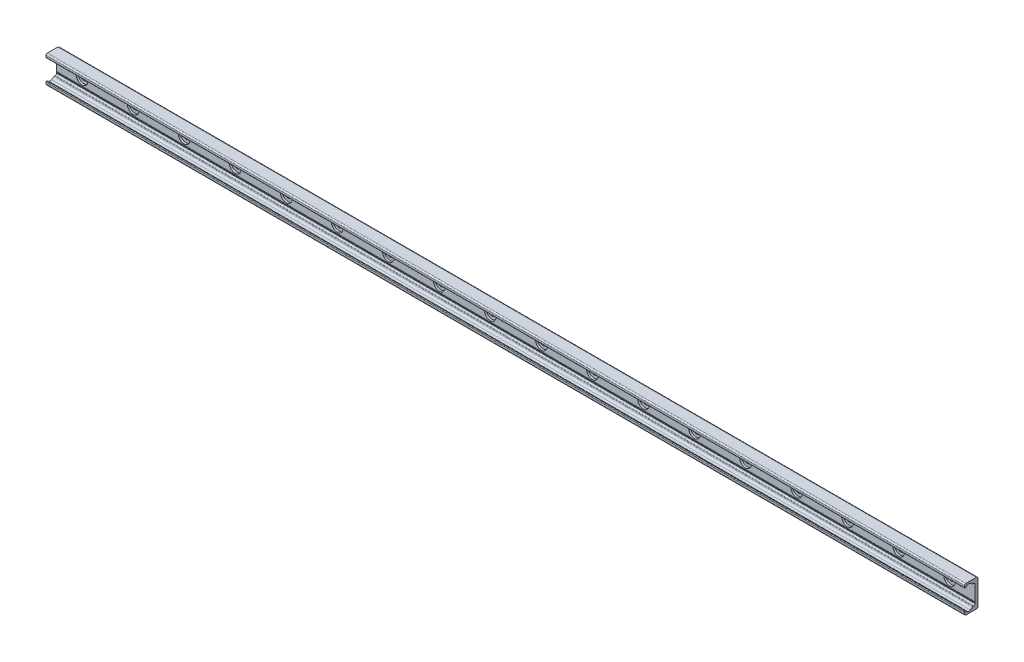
from build123d import *

# Parameters (mm, degrees)
BOSS_EXTRUDE1_DEPTH = 720
SKETCH2_R           = 9
SKETCH2_R_2         = 4.5
CUT_EXTRUDE1_DEPTH  = 3.1
SKETCH2_2_R         = 4.5
CUT_EXTRUDE2_DEPTH  = 721.509888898
LPATTERN1_COUNT     = 18
LPATTERN1_PITCH     = 80


with BuildPart() as part:
    # Sketch1 → Boss-Extrude1 (new, symmetric)
    with BuildSketch(Plane(origin=(0, 0, 0), x_dir=(0, 0, -1), z_dir=(1, 0, 0))):
        with BuildLine():
            Line((0, 0), (0, 19))
            ThreePointArc((0, 19), (-0.732233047, 20.767766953), (-2.5, 21.5))
            Line((-2.5, 21.5), (-19, 21.5))
            ThreePointArc((-19, 21.5), (-20.414213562, 20.914213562), (-21, 19.5))
            Line((-21, 19.5), (-21, 16.625057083))
            ThreePointArc((-21, 16.625057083), (-20.553251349, 15.888838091), (-19.693931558, 15.945160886))
            Line((-19.693931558, 15.945160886), (-16.794305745, 17.975500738))
            ThreePointArc((-16.794305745, 17.975500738), (-14.5, 18.69889256), (-12.205694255, 17.975500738))
            Line((-12.205694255, 17.975500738), (-8.829831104, 15.611695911))
            ThreePointArc((-8.829831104, 15.611695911), (-8.28408983, 15.342566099), (-7.682678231, 15.25))
            Line((-7.682678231, 15.25), (-6.5, 15.25))
            ThreePointArc((-6.5, 15.25), (-5.085786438, 14.664213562), (-4.5, 13.25))
            Line((-4.5, 13.25), (-4.5, -10.75))
            ThreePointArc((-4.5, -10.75), (-4.25, -11), (-4.5, -11.25))
            Line((-4.5, -11.25), (-4.5, -12.25))
            ThreePointArc((-4.5, -12.25), (-4.25, -12.5), (-4.5, -12.75))
            Line((-4.5, -12.75), (-4.5, -13.25))
            ThreePointArc((-4.5, -13.25), (-5.085786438, -14.664213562), (-6.5, -15.25))
            Line((-6.5, -15.25), (-7.682678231, -15.25))
            ThreePointArc((-7.682678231, -15.25), (-8.28408983, -15.342566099), (-8.829831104, -15.611695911))
            Line((-8.829831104, -15.611695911), (-12.205694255, -17.975500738))
            ThreePointArc((-12.205694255, -17.975500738), (-14.5, -18.69889256), (-16.794305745, -17.975500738))
            Line((-16.794305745, -17.975500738), (-19.693931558, -15.945160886))
            ThreePointArc((-19.693931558, -15.945160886), (-20.553251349, -15.888838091), (-21, -16.625057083))
            Line((-21, -16.625057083), (-21, -19.5))
            ThreePointArc((-21, -19.5), (-20.414213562, -20.914213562), (-19, -21.5))
            Line((-19, -21.5), (-2.5, -21.5))
            ThreePointArc((-2.5, -21.5), (-0.732233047, -20.767766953), (0, -19))
            Line((0, -19), (0, 0))
        make_face()
    extrude(amount=BOSS_EXTRUDE1_DEPTH, both=True)

    # Sketch2 → Cut-Extrude1 (cut)
    with BuildSketch(Plane.XY.offset(4.5)):
        with Locations((680, 0)):
            Circle(SKETCH2_R)
        with Locations((680, 0)):
            Circle(SKETCH2_R_2, mode=Mode.SUBTRACT)
    cut_extrude1 = extrude(amount=-CUT_EXTRUDE1_DEPTH, mode=Mode.SUBTRACT)

    # Sketch2_2 → Cut-Extrude2 (cut, through all)
    with BuildSketch(Plane.XY.offset(4.5)):
        with Locations((680, 0)):
            Circle(SKETCH2_2_R)
    cut_extrude2 = extrude(amount=-CUT_EXTRUDE2_DEPTH, mode=Mode.SUBTRACT)

    # LPattern1: Cut-Extrude1, Cut-Extrude2 ×18
    with Locations(*[(-i * LPATTERN1_PITCH, 0, 0) for i in range(1, LPATTERN1_COUNT)]):
        add(cut_extrude1, mode=Mode.SUBTRACT)
        add(cut_extrude2, mode=Mode.SUBTRACT)


solid = part.part
